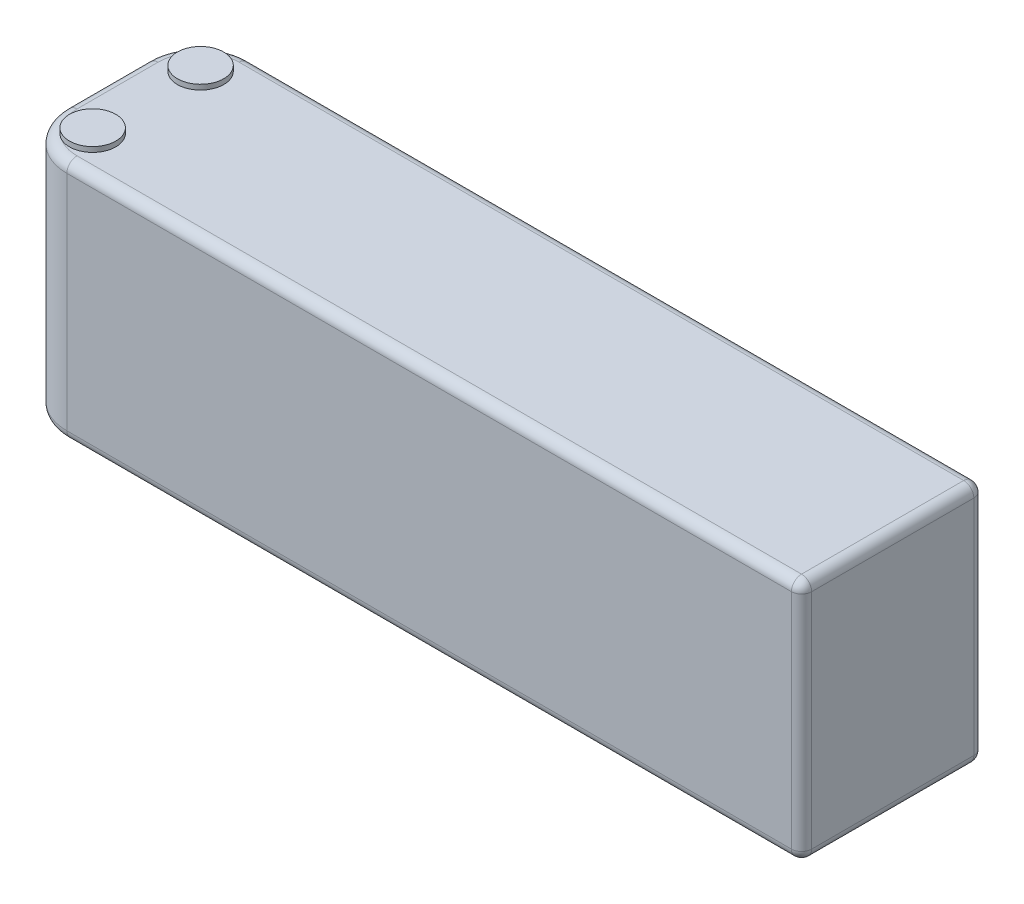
from build123d import *

# Parameters (mm, degrees)
BOSS_EXTRUDE1_DEPTH = 48
FILLET1_R           = 2
SKETCH7_R           = 4.572679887
BOSS_EXTRUDE3_DEPTH = 1


with BuildPart() as part:
    # Sketch3 → Boss-Extrude1 (new body)
    with BuildSketch(Plane(origin=(0, 0, 0), x_dir=(1, 0, 0), z_dir=(0, 1, 0))):
        with BuildLine():
            Line((10, 0), (155, 0))
            Line((155, 0), (155, 36))
            Line((155, 36), (10, 36))
            ThreePointArc((10, 36), (2.928932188, 33.071067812), (0, 26))
            Line((0, 26), (0, 10))
            ThreePointArc((0, 10), (2.928932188, 2.928932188), (10, 0))
        make_face()
    extrude(amount=BOSS_EXTRUDE1_DEPTH)

    # Fillet1
    fillet1_edges = [part.edges().sort_by_distance(p)[0] for p in [
        (155, 24, 0),
        (155, 24, -36),
        (2.928932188, 48, -33.071067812),
        (0, 48, -18),
        (2.928932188, 48, -2.928932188),
        (82.5, 48, 0),
        (155, 48, -18),
        (82.5, 0, 0),
        (2.928932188, 0, -2.928932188),
        (0, 0, -18),
        (2.928932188, 0, -33.071067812),
        (82.5, 0, -36),
        (155, 0, -18),
        (82.5, 48, -36),
    ]]
    fillet(fillet1_edges, radius=FILLET1_R)

    # Sketch7 → Boss-Extrude3 (add)
    with BuildSketch(Plane(origin=(0, 48, 0), x_dir=(1, 0, 0), z_dir=(0, 1, 0))):
        with Locations(Location((7.738139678, 28.650889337, 0), (0, 0, 116.659797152))):
            Circle(SKETCH7_R)
        with Locations(Location((7.738139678, 7.349110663, 0), (0, 0, 90))):
            Circle(SKETCH7_R)
    extrude(amount=BOSS_EXTRUDE3_DEPTH)


solid = part.part
